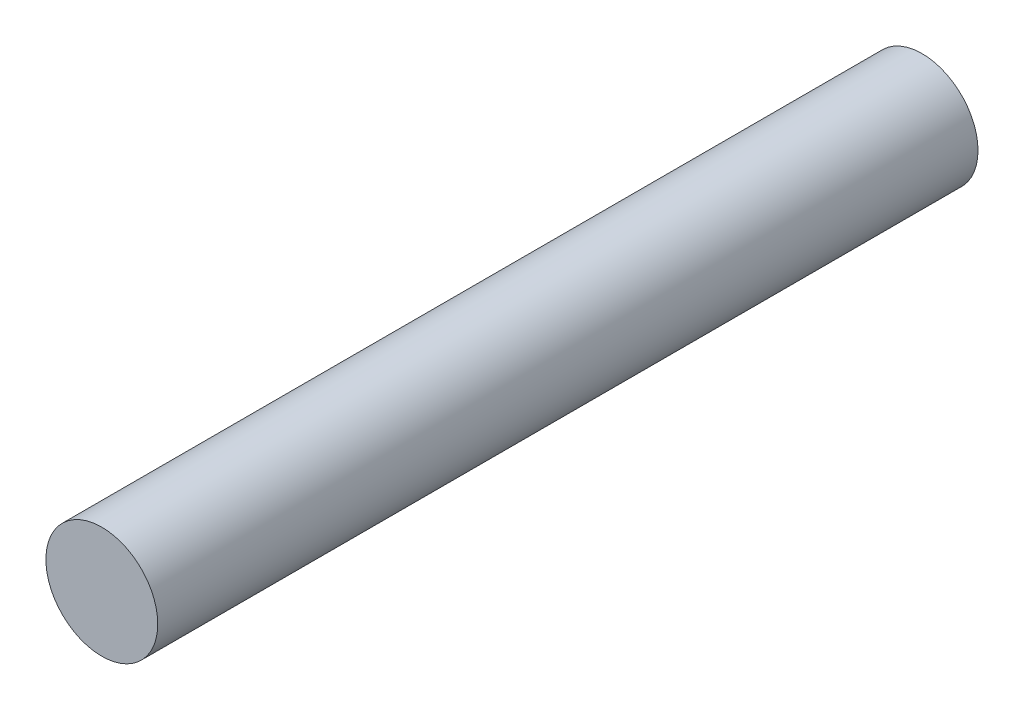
from build123d import *

# Parameters (mm, degrees)
SKETCH6_R           = 7.5
BOSS_EXTRUDE1_DEPTH = 110


with BuildPart() as part:
    # Sketch6 → Boss-Extrude1 (new body)
    with BuildSketch(Plane.XY):
        Circle(SKETCH6_R)
    extrude(amount=BOSS_EXTRUDE1_DEPTH)


solid = part.part
